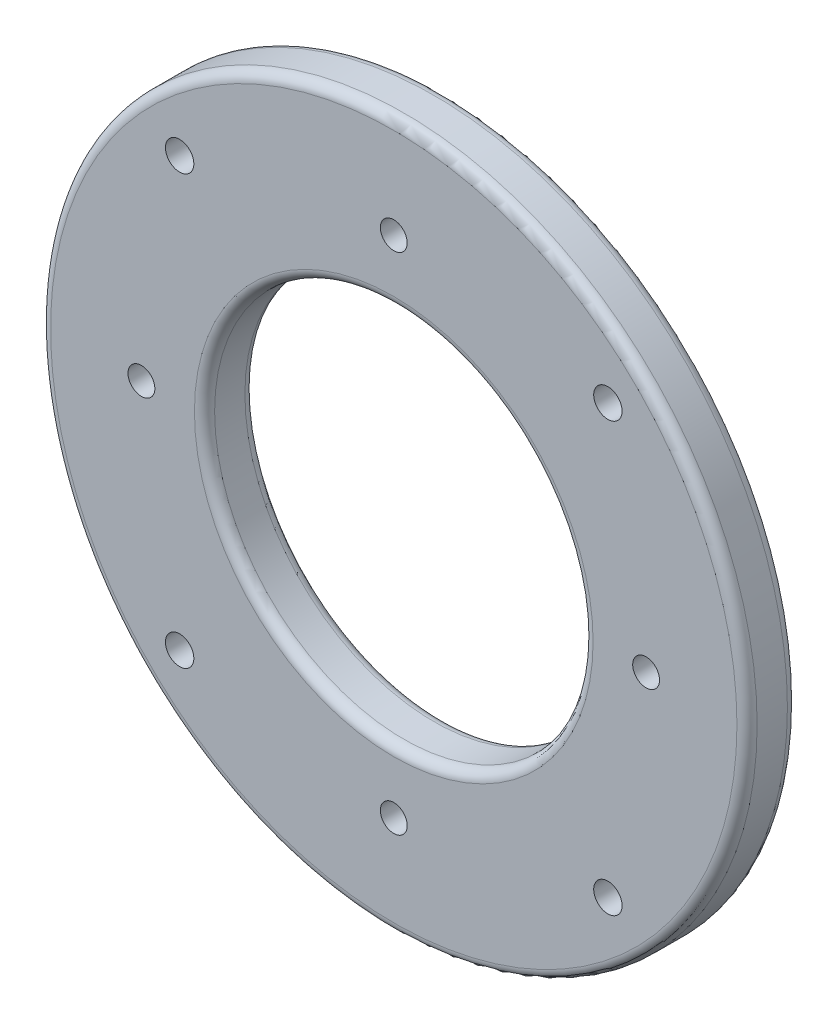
from build123d import *

# Parameters (mm, degrees)
SKETCH1_R               = 88.9
SKETCH1_R_2             = 47.625
BOSS_EXTRUDE1_DEPTH     = 12.7
F_1_4_CLEARANCE_HOLE2_D = 6.7564
F_1_4_CLEARANCE_HOLE1_D = 7.14248
CIRPATTERN1_COUNT       = 4
FILLET1_R               = 2.54


with BuildPart() as part:
    # Sketch1 → Boss-Extrude1 (new body)
    with BuildSketch(Plane.XY):
        Circle(SKETCH1_R)
        Circle(SKETCH1_R_2, mode=Mode.SUBTRACT)
    extrude(amount=BOSS_EXTRUDE1_DEPTH)

    # 1_4 Clearance Hole2 (through all)
    with Locations(Plane.XY.offset(12.7)):
        with Locations((-63.5, 0), (63.5, 0), (0, -63.5), (0, 63.5)):
            Hole(F_1_4_CLEARANCE_HOLE2_D / 2)

    # 1_4 Clearance Hole1 (through all)
    with Locations(Plane.XY.offset(12.7)):
        with Locations((-53.881536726, 53.881536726)):
            f_1_4_clearance_hole1 = Hole(F_1_4_CLEARANCE_HOLE1_D / 2)

    # CirPattern1: 1_4 Clearance Hole1 ×4 about axis
    cirpattern1_axis = Axis((0, 0, 0), (0, 0, -1))
    for i in range(1, CIRPATTERN1_COUNT):
        add(f_1_4_clearance_hole1.rotate(cirpattern1_axis, i * 360 / CIRPATTERN1_COUNT), mode=Mode.SUBTRACT)

    # Fillet1
    fillet1_edges = [part.edges().sort_by_distance(p)[0] for p in [
        (-88.9, 0, 0),
        (-88.9, 0, 12.7),
        (-47.625, 0, 0),
        (-47.625, 0, 12.7),
    ]]
    fillet(fillet1_edges, radius=FILLET1_R)


solid = part.part
